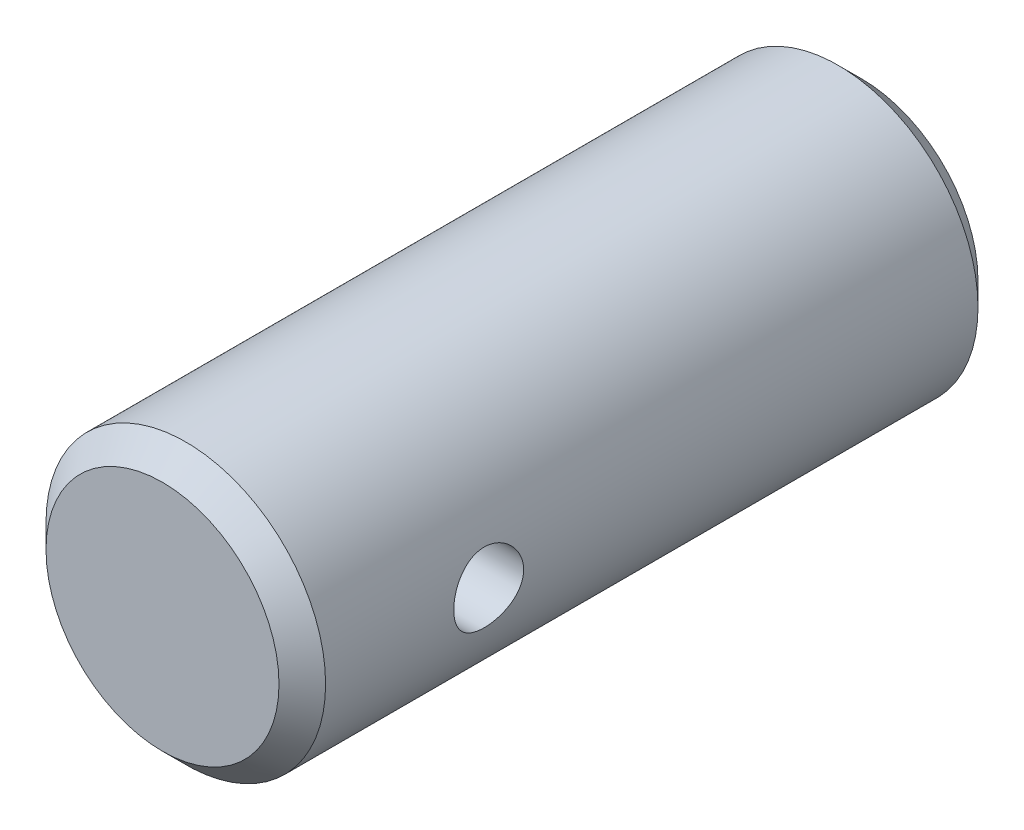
from build123d import *

# Parameters (mm, degrees)
ESQUISSE1_R                  = 6
BASE_EXTRUSION_DEPTH         = 30
CHANFREIN1_SIZE              = 1
ENL_V_MAT_EXTRU_1_DEPTH      = 30
ENL_V_MAT_EXTRU_1_DEPTH_BACK = 30
ESQUISSE2_R                  = 1.5


with BuildPart() as part:
    # Esquisse1 → Base-Extrusion (new body)
    with BuildSketch(Plane.XY):
        Circle(ESQUISSE1_R)
    extrude(amount=BASE_EXTRUSION_DEPTH)

    # Chanfrein1
    chanfrein1_edges = [part.edges().sort_by_distance(p)[0] for p in [
        (-6, 0, 0),
        (-6, 0, 30),
    ]]
    chamfer(chanfrein1_edges, length=CHANFREIN1_SIZE)

    # Esquisse2 → Enl_v. mat.-Extru.1 (cut, two sides: drawn at the far end of the back side and taken through both)
    with BuildSketch(Plane(origin=(0, 0, 0), x_dir=(0, 0, -1), z_dir=(1, 0, 0)).offset(-ENL_V_MAT_EXTRU_1_DEPTH_BACK)):
        with Locations(Location((-22, 0, 0), (0, 0, 180))):
            Circle(ESQUISSE2_R)
    extrude(amount=ENL_V_MAT_EXTRU_1_DEPTH + ENL_V_MAT_EXTRU_1_DEPTH_BACK, mode=Mode.SUBTRACT)


solid = part.part
